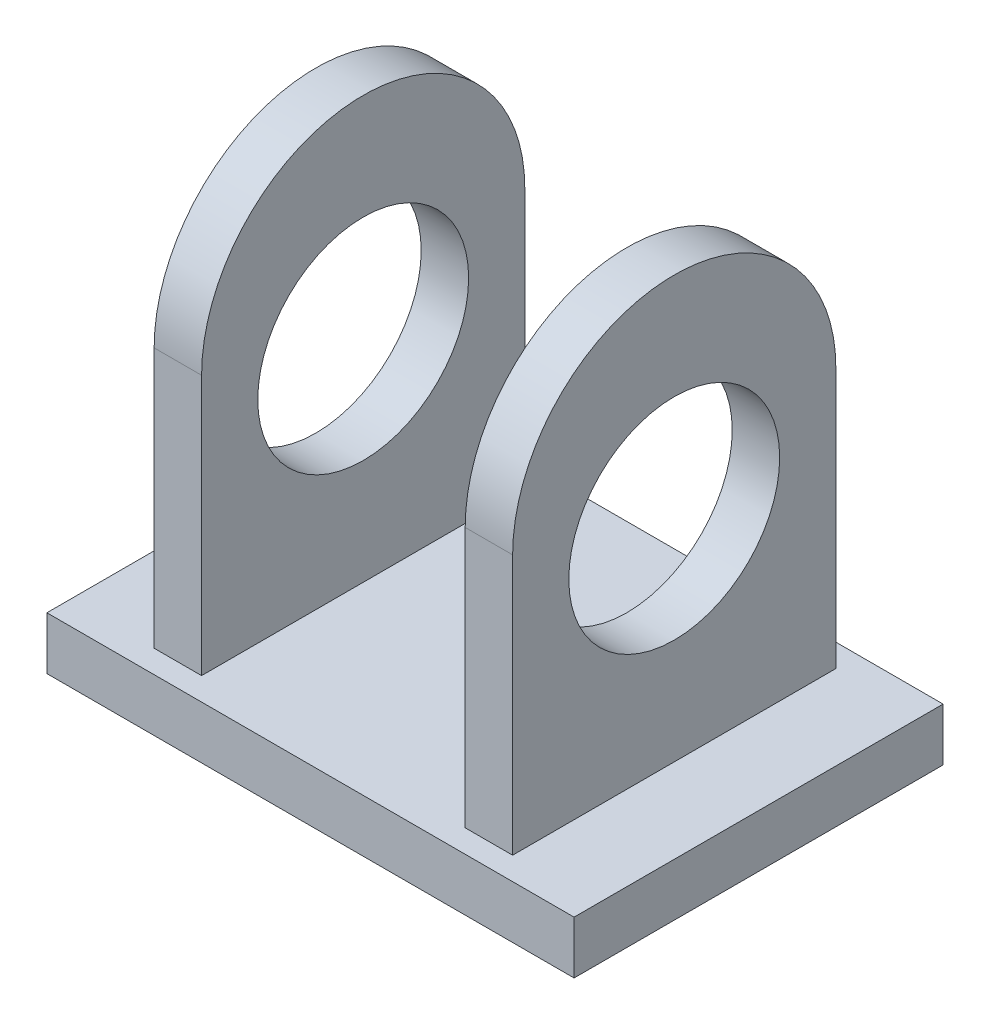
ISO-10303-21;
HEADER;
FILE_DESCRIPTION(('STEP AP214'),'2;1');
FILE_NAME('part.step','',(''),(''),'','','');
FILE_SCHEMA(('AUTOMOTIVE_DESIGN { 1 0 10303 214 1 1 1 1 }'));
ENDSEC;
DATA;
#1=APPLICATION_CONTEXT('core data for automotive mechanical design processes');
#2=APPLICATION_PROTOCOL_DEFINITION('international standard','automotive_design',2000,#1);
#3=PRODUCT_CONTEXT('',#1,'mechanical');
#4=PRODUCT('Part','Part','',(#3));
#5=PRODUCT_RELATED_PRODUCT_CATEGORY('part','',(#4));
#6=PRODUCT_DEFINITION_FORMATION('','',#4);
#7=PRODUCT_DEFINITION_CONTEXT('part definition',#1,'design');
#8=PRODUCT_DEFINITION('design','',#6,#7);
#9=PRODUCT_DEFINITION_SHAPE('','',#8);
#10=(LENGTH_UNIT() NAMED_UNIT(*) SI_UNIT(.MILLI.,.METRE.));
#11=(NAMED_UNIT(*) PLANE_ANGLE_UNIT() SI_UNIT($,.RADIAN.));
#12=(NAMED_UNIT(*) SI_UNIT($,.STERADIAN.) SOLID_ANGLE_UNIT());
#13=UNCERTAINTY_MEASURE_WITH_UNIT(LENGTH_MEASURE(1.E-05),#10,'distance_accuracy_value','');
#14=(GEOMETRIC_REPRESENTATION_CONTEXT(3) GLOBAL_UNCERTAINTY_ASSIGNED_CONTEXT((#13)) GLOBAL_UNIT_ASSIGNED_CONTEXT((#10,
#11,#12)) REPRESENTATION_CONTEXT('',''));
#15=CARTESIAN_POINT('',(0.,0.,0.));
#16=DIRECTION('',(0.,0.,1.));
#17=DIRECTION('',(1.,0.,0.));
#18=AXIS2_PLACEMENT_3D('',#15,#16,#17);
#19=CARTESIAN_POINT('',(17.,34.6714011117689,0.));
#20=DIRECTION('',(1.,0.,0.));
#21=DIRECTION('',(0.,0.,-1.));
#22=AXIS2_PLACEMENT_3D('',#19,#20,#21);
#23=CYLINDRICAL_SURFACE('',#22,15.3285988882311);
#24=CARTESIAN_POINT('',(-12.5,34.6714011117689,0.));
#25=DIRECTION('',(-1.,0.,0.));
#26=DIRECTION('',(0.,0.,1.));
#27=AXIS2_PLACEMENT_3D('',#24,#25,#26);
#28=CIRCLE('',#27,15.3285988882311);
#29=CARTESIAN_POINT('',(-12.5,34.6714011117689,-15.3285988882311));
#30=VERTEX_POINT('',#29);
#31=CARTESIAN_POINT('',(-12.5,34.6714011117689,15.3285988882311));
#32=VERTEX_POINT('',#31);
#33=EDGE_CURVE('E269',#30,#32,#28,.F.);
#34=ORIENTED_EDGE('',*,*,#33,.F.);
#35=DIRECTION('',(1.,0.,0.));
#36=VECTOR('',#35,1.);
#37=CARTESIAN_POINT('',(-17.,34.6714011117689,-15.3285988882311));
#38=LINE('',#37,#36);
#39=CARTESIAN_POINT('',(-17.,34.6714011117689,-15.3285988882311));
#40=VERTEX_POINT('',#39);
#41=EDGE_CURVE('E250',#40,#30,#38,.T.);
#42=ORIENTED_EDGE('',*,*,#41,.F.);
#43=CARTESIAN_POINT('',(-17.,34.6714011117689,0.));
#44=DIRECTION('',(1.,0.,0.));
#45=DIRECTION('',(0.,0.,-1.));
#46=AXIS2_PLACEMENT_3D('',#43,#44,#45);
#47=CIRCLE('',#46,15.3285988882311);
#48=CARTESIAN_POINT('',(-17.,34.6714011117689,15.3285988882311));
#49=VERTEX_POINT('',#48);
#50=EDGE_CURVE('E54',#49,#40,#47,.F.);
#51=ORIENTED_EDGE('',*,*,#50,.F.);
#52=DIRECTION('',(1.,0.,0.));
#53=VECTOR('',#52,1.);
#54=CARTESIAN_POINT('',(-17.,34.6714011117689,15.3285988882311));
#55=LINE('',#54,#53);
#56=EDGE_CURVE('E244',#32,#49,#55,.F.);
#57=ORIENTED_EDGE('',*,*,#56,.F.);
#58=EDGE_LOOP('',(#34,#42,#51,#57));
#59=FACE_BOUND('',#58,.T.);
#60=ADVANCED_FACE('F43',(#59),#23,.T.);
#61=CARTESIAN_POINT('',(-17.,50.,-15.3285988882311));
#62=DIRECTION('',(0.,0.,1.));
#63=DIRECTION('',(1.,0.,0.));
#64=AXIS2_PLACEMENT_3D('',#61,#62,#63);
#65=PLANE('',#64);
#66=ORIENTED_EDGE('',*,*,#41,.T.);
#67=DIRECTION('',(0.,-1.,0.));
#68=VECTOR('',#67,1.);
#69=CARTESIAN_POINT('',(-12.5,50.,-15.3285988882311));
#70=LINE('',#69,#68);
#71=CARTESIAN_POINT('',(-12.5,10.,-15.3285988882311));
#72=VERTEX_POINT('',#71);
#73=EDGE_CURVE('E274',#30,#72,#70,.T.);
#74=ORIENTED_EDGE('',*,*,#73,.T.);
#75=DIRECTION('',(-1.,0.,0.));
#76=VECTOR('',#75,1.);
#77=CARTESIAN_POINT('',(-17.,10.,-15.3285988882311));
#78=LINE('',#77,#76);
#79=CARTESIAN_POINT('',(-17.,10.,-15.3285988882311));
#80=VERTEX_POINT('',#79);
#81=EDGE_CURVE('E273',#72,#80,#78,.T.);
#82=ORIENTED_EDGE('',*,*,#81,.T.);
#83=DIRECTION('',(0.,-1.,0.));
#84=VECTOR('',#83,1.);
#85=CARTESIAN_POINT('',(-17.,50.,-15.3285988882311));
#86=LINE('',#85,#84);
#87=EDGE_CURVE('E182',#40,#80,#86,.T.);
#88=ORIENTED_EDGE('',*,*,#87,.F.);
#89=EDGE_LOOP('',(#66,#74,#82,#88));
#90=FACE_BOUND('',#89,.T.);
#91=ADVANCED_FACE('F272',(#90),#65,.F.);
#92=CARTESIAN_POINT('',(-17.,50.,15.3285988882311));
#93=DIRECTION('',(0.,0.,-1.));
#94=DIRECTION('',(-1.,0.,0.));
#95=AXIS2_PLACEMENT_3D('',#92,#93,#94);
#96=PLANE('',#95);
#97=DIRECTION('',(1.,0.,0.));
#98=VECTOR('',#97,1.);
#99=CARTESIAN_POINT('',(-17.,10.,15.3285988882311));
#100=LINE('',#99,#98);
#101=CARTESIAN_POINT('',(-17.,10.,15.3285988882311));
#102=VERTEX_POINT('',#101);
#103=CARTESIAN_POINT('',(-12.5,10.,15.3285988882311));
#104=VERTEX_POINT('',#103);
#105=EDGE_CURVE('E164',#102,#104,#100,.T.);
#106=ORIENTED_EDGE('',*,*,#105,.T.);
#107=DIRECTION('',(0.,1.,0.));
#108=VECTOR('',#107,1.);
#109=CARTESIAN_POINT('',(-12.5,50.,15.3285988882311));
#110=LINE('',#109,#108);
#111=EDGE_CURVE('E11',#104,#32,#110,.T.);
#112=ORIENTED_EDGE('',*,*,#111,.T.);
#113=ORIENTED_EDGE('',*,*,#56,.T.);
#114=DIRECTION('',(0.,-1.,0.));
#115=VECTOR('',#114,1.);
#116=CARTESIAN_POINT('',(-17.,50.,15.3285988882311));
#117=LINE('',#116,#115);
#118=EDGE_CURVE('E179',#49,#102,#117,.T.);
#119=ORIENTED_EDGE('',*,*,#118,.T.);
#120=EDGE_LOOP('',(#106,#112,#113,#119));
#121=FACE_BOUND('',#120,.T.);
#122=ADVANCED_FACE('F354',(#121),#96,.F.);
#123=CARTESIAN_POINT('',(12.5,34.6714011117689,0.));
#124=DIRECTION('',(1.,0.,0.));
#125=DIRECTION('',(0.,0.,-1.));
#126=AXIS2_PLACEMENT_3D('',#123,#124,#125);
#127=CIRCLE('',#126,15.3285988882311);
#128=CARTESIAN_POINT('',(12.5,34.6714011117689,15.3285988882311));
#129=VERTEX_POINT('',#128);
#130=CARTESIAN_POINT('',(12.5,34.6714011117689,-15.3285988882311));
#131=VERTEX_POINT('',#130);
#132=EDGE_CURVE('E285',#129,#131,#127,.F.);
#133=ORIENTED_EDGE('',*,*,#132,.F.);
#134=CARTESIAN_POINT('',(17.,34.6714011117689,15.3285988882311));
#135=VERTEX_POINT('',#134);
#136=EDGE_CURVE('E155',#135,#129,#55,.F.);
#137=ORIENTED_EDGE('',*,*,#136,.F.);
#138=CARTESIAN_POINT('',(17.,34.6714011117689,0.));
#139=DIRECTION('',(-1.,0.,0.));
#140=DIRECTION('',(0.,0.,1.));
#141=AXIS2_PLACEMENT_3D('',#138,#139,#140);
#142=CIRCLE('',#141,15.3285988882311);
#143=CARTESIAN_POINT('',(17.,34.6714011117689,-15.3285988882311));
#144=VERTEX_POINT('',#143);
#145=EDGE_CURVE('E254',#144,#135,#142,.F.);
#146=ORIENTED_EDGE('',*,*,#145,.F.);
#147=EDGE_CURVE('E69',#131,#144,#38,.T.);
#148=ORIENTED_EDGE('',*,*,#147,.F.);
#149=EDGE_LOOP('',(#133,#137,#146,#148));
#150=FACE_BOUND('',#149,.T.);
#151=ADVANCED_FACE('F46',(#150),#23,.T.);
#152=CARTESIAN_POINT('',(0.,10.,0.));
#153=DIRECTION('',(0.,-1.,0.));
#154=DIRECTION('',(0.,0.,-1.));
#155=AXIS2_PLACEMENT_3D('',#152,#153,#154);
#156=PLANE('',#155);
#157=DIRECTION('',(-1.,0.,0.));
#158=VECTOR('',#157,1.);
#159=CARTESIAN_POINT('',(-25.,10.,-17.5));
#160=LINE('',#159,#158);
#161=CARTESIAN_POINT('',(25.,10.,-17.5));
#162=VERTEX_POINT('',#161);
#163=CARTESIAN_POINT('',(-25.,10.,-17.5));
#164=VERTEX_POINT('',#163);
#165=EDGE_CURVE('E194',#162,#164,#160,.T.);
#166=ORIENTED_EDGE('',*,*,#165,.T.);
#167=DIRECTION('',(0.,0.,1.));
#168=VECTOR('',#167,1.);
#169=CARTESIAN_POINT('',(-25.,10.,17.5));
#170=LINE('',#169,#168);
#171=CARTESIAN_POINT('',(-25.,10.,17.5));
#172=VERTEX_POINT('',#171);
#173=EDGE_CURVE('E198',#164,#172,#170,.T.);
#174=ORIENTED_EDGE('',*,*,#173,.T.);
#175=DIRECTION('',(1.,0.,0.));
#176=VECTOR('',#175,1.);
#177=CARTESIAN_POINT('',(-25.,10.,17.5));
#178=LINE('',#177,#176);
#179=CARTESIAN_POINT('',(25.,10.,17.5));
#180=VERTEX_POINT('',#179);
#181=EDGE_CURVE('E201',#172,#180,#178,.T.);
#182=ORIENTED_EDGE('',*,*,#181,.T.);
#183=DIRECTION('',(0.,0.,-1.));
#184=VECTOR('',#183,1.);
#185=CARTESIAN_POINT('',(25.,10.,17.5));
#186=LINE('',#185,#184);
#187=EDGE_CURVE('E190',#180,#162,#186,.T.);
#188=ORIENTED_EDGE('',*,*,#187,.T.);
#189=EDGE_LOOP('',(#166,#174,#182,#188));
#190=FACE_BOUND('',#189,.T.);
#191=DIRECTION('',(0.,0.,1.));
#192=VECTOR('',#191,1.);
#193=CARTESIAN_POINT('',(12.5,10.,-17.5));
#194=LINE('',#193,#192);
#195=CARTESIAN_POINT('',(12.5,10.,-15.3285988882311));
#196=VERTEX_POINT('',#195);
#197=CARTESIAN_POINT('',(12.5,10.,15.3285988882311));
#198=VERTEX_POINT('',#197);
#199=EDGE_CURVE('E136',#196,#198,#194,.T.);
#200=ORIENTED_EDGE('',*,*,#199,.F.);
#201=CARTESIAN_POINT('',(17.,10.,-15.3285988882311));
#202=VERTEX_POINT('',#201);
#203=EDGE_CURVE('E173',#202,#196,#78,.T.);
#204=ORIENTED_EDGE('',*,*,#203,.F.);
#205=DIRECTION('',(0.,0.,-1.));
#206=VECTOR('',#205,1.);
#207=CARTESIAN_POINT('',(17.,10.,15.3285988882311));
#208=LINE('',#207,#206);
#209=CARTESIAN_POINT('',(17.,10.,15.3285988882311));
#210=VERTEX_POINT('',#209);
#211=EDGE_CURVE('E162',#210,#202,#208,.T.);
#212=ORIENTED_EDGE('',*,*,#211,.F.);
#213=EDGE_CURVE('E152',#198,#210,#100,.T.);
#214=ORIENTED_EDGE('',*,*,#213,.F.);
#215=EDGE_LOOP('',(#200,#204,#212,#214));
#216=FACE_BOUND('',#215,.T.);
#217=ORIENTED_EDGE('',*,*,#81,.F.);
#218=DIRECTION('',(0.,0.,1.));
#219=VECTOR('',#218,1.);
#220=CARTESIAN_POINT('',(-12.5,10.,-17.5));
#221=LINE('',#220,#219);
#222=EDGE_CURVE('E61',#72,#104,#221,.T.);
#223=ORIENTED_EDGE('',*,*,#222,.T.);
#224=ORIENTED_EDGE('',*,*,#105,.F.);
#225=DIRECTION('',(0.,0.,1.));
#226=VECTOR('',#225,1.);
#227=CARTESIAN_POINT('',(-17.,10.,15.3285988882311));
#228=LINE('',#227,#226);
#229=EDGE_CURVE('E165',#80,#102,#228,.T.);
#230=ORIENTED_EDGE('',*,*,#229,.F.);
#231=EDGE_LOOP('',(#217,#223,#224,#230));
#232=FACE_BOUND('',#231,.T.);
#233=ADVANCED_FACE('F160',(#190,#216,#232),#156,.F.);
#234=CARTESIAN_POINT('',(0.,0.,0.));
#235=DIRECTION('',(0.,1.,0.));
#236=DIRECTION('',(0.,0.,1.));
#237=AXIS2_PLACEMENT_3D('',#234,#235,#236);
#238=PLANE('',#237);
#239=CARTESIAN_POINT('',(0.,0.,0.));
#240=DIRECTION('',(0.,1.,0.));
#241=DIRECTION('',(0.,0.,1.));
#242=AXIS2_PLACEMENT_3D('',#239,#240,#241);
#243=CIRCLE('',#242,11.5);
#244=CARTESIAN_POINT('',(0.,0.,11.5));
#245=VERTEX_POINT('',#244);
#246=EDGE_CURVE('E239',#245,#245,#243,.T.);
#247=ORIENTED_EDGE('',*,*,#246,.F.);
#248=EDGE_LOOP('',(#247));
#249=FACE_BOUND('',#248,.T.);
#250=CARTESIAN_POINT('',(0.,0.,0.));
#251=DIRECTION('',(0.,1.,0.));
#252=DIRECTION('',(0.,0.,1.));
#253=AXIS2_PLACEMENT_3D('',#250,#251,#252);
#254=CIRCLE('',#253,10.5);
#255=CARTESIAN_POINT('',(0.,0.,10.5));
#256=VERTEX_POINT('',#255);
#257=EDGE_CURVE('E235',#256,#256,#254,.T.);
#258=ORIENTED_EDGE('',*,*,#257,.T.);
#259=EDGE_LOOP('',(#258));
#260=FACE_BOUND('',#259,.T.);
#261=ADVANCED_FACE('F376',(#249,#260),#238,.F.);
#262=CARTESIAN_POINT('',(0.,5.,0.));
#263=DIRECTION('',(0.,-1.,0.));
#264=DIRECTION('',(0.,0.,-1.));
#265=AXIS2_PLACEMENT_3D('',#262,#263,#264);
#266=CYLINDRICAL_SURFACE('',#265,11.5);
#267=CARTESIAN_POINT('',(0.,5.,0.));
#268=DIRECTION('',(0.,1.,0.));
#269=DIRECTION('',(0.,0.,1.));
#270=AXIS2_PLACEMENT_3D('',#267,#268,#269);
#271=CIRCLE('',#270,11.5);
#272=CARTESIAN_POINT('',(0.,5.,11.5));
#273=VERTEX_POINT('',#272);
#274=EDGE_CURVE('E240',#273,#273,#271,.T.);
#275=ORIENTED_EDGE('',*,*,#274,.F.);
#276=EDGE_LOOP('',(#275));
#277=FACE_BOUND('',#276,.T.);
#278=ORIENTED_EDGE('',*,*,#246,.T.);
#279=EDGE_LOOP('',(#278));
#280=FACE_BOUND('',#279,.T.);
#281=ADVANCED_FACE('F409',(#277,#280),#266,.T.);
#282=CARTESIAN_POINT('',(0.,5.,0.));
#283=DIRECTION('',(0.,-1.,0.));
#284=DIRECTION('',(0.,0.,-1.));
#285=AXIS2_PLACEMENT_3D('',#282,#283,#284);
#286=CYLINDRICAL_SURFACE('',#285,10.5);
#287=CARTESIAN_POINT('',(0.,5.,0.));
#288=DIRECTION('',(0.,1.,0.));
#289=DIRECTION('',(0.,0.,1.));
#290=AXIS2_PLACEMENT_3D('',#287,#288,#289);
#291=CIRCLE('',#290,10.5);
#292=CARTESIAN_POINT('',(0.,5.,10.5));
#293=VERTEX_POINT('',#292);
#294=EDGE_CURVE('E231',#293,#293,#291,.T.);
#295=ORIENTED_EDGE('',*,*,#294,.T.);
#296=EDGE_LOOP('',(#295));
#297=FACE_BOUND('',#296,.T.);
#298=ORIENTED_EDGE('',*,*,#257,.F.);
#299=EDGE_LOOP('',(#298));
#300=FACE_BOUND('',#299,.T.);
#301=ADVANCED_FACE('F406',(#297,#300),#286,.F.);
#302=CARTESIAN_POINT('',(0.,5.,0.));
#303=DIRECTION('',(0.,-1.,0.));
#304=DIRECTION('',(0.,0.,-1.));
#305=AXIS2_PLACEMENT_3D('',#302,#303,#304);
#306=PLANE('',#305);
#307=ORIENTED_EDGE('',*,*,#294,.F.);
#308=EDGE_LOOP('',(#307));
#309=FACE_BOUND('',#308,.T.);
#310=ADVANCED_FACE('F390',(#309),#306,.T.);
#311=CARTESIAN_POINT('',(25.,10.,17.5));
#312=DIRECTION('',(-1.,0.,0.));
#313=DIRECTION('',(0.,0.,1.));
#314=AXIS2_PLACEMENT_3D('',#311,#312,#313);
#315=PLANE('',#314);
#316=DIRECTION('',(0.,0.,-1.));
#317=VECTOR('',#316,1.);
#318=CARTESIAN_POINT('',(25.,5.,17.5));
#319=LINE('',#318,#317);
#320=CARTESIAN_POINT('',(25.,5.,17.5));
#321=VERTEX_POINT('',#320);
#322=CARTESIAN_POINT('',(25.,5.,-17.5));
#323=VERTEX_POINT('',#322);
#324=EDGE_CURVE('E189',#321,#323,#319,.T.);
#325=ORIENTED_EDGE('',*,*,#324,.T.);
#326=DIRECTION('',(0.,-1.,0.));
#327=VECTOR('',#326,1.);
#328=CARTESIAN_POINT('',(25.,10.,-17.5));
#329=LINE('',#328,#327);
#330=EDGE_CURVE('E227',#162,#323,#329,.T.);
#331=ORIENTED_EDGE('',*,*,#330,.F.);
#332=ORIENTED_EDGE('',*,*,#187,.F.);
#333=DIRECTION('',(0.,-1.,0.));
#334=VECTOR('',#333,1.);
#335=CARTESIAN_POINT('',(25.,10.,17.5));
#336=LINE('',#335,#334);
#337=EDGE_CURVE('E204',#180,#321,#336,.T.);
#338=ORIENTED_EDGE('',*,*,#337,.T.);
#339=EDGE_LOOP('',(#325,#331,#332,#338));
#340=FACE_BOUND('',#339,.T.);
#341=ADVANCED_FACE('F401',(#340),#315,.F.);
#342=CARTESIAN_POINT('',(-25.,10.,-17.5));
#343=DIRECTION('',(0.,0.,1.));
#344=DIRECTION('',(1.,0.,0.));
#345=AXIS2_PLACEMENT_3D('',#342,#343,#344);
#346=PLANE('',#345);
#347=DIRECTION('',(-1.,0.,0.));
#348=VECTOR('',#347,1.);
#349=CARTESIAN_POINT('',(-25.,5.,-17.5));
#350=LINE('',#349,#348);
#351=CARTESIAN_POINT('',(-25.,5.,-17.5));
#352=VERTEX_POINT('',#351);
#353=EDGE_CURVE('E208',#323,#352,#350,.T.);
#354=ORIENTED_EDGE('',*,*,#353,.T.);
#355=DIRECTION('',(0.,-1.,0.));
#356=VECTOR('',#355,1.);
#357=CARTESIAN_POINT('',(-25.,10.,-17.5));
#358=LINE('',#357,#356);
#359=EDGE_CURVE('E223',#164,#352,#358,.T.);
#360=ORIENTED_EDGE('',*,*,#359,.F.);
#361=ORIENTED_EDGE('',*,*,#165,.F.);
#362=ORIENTED_EDGE('',*,*,#330,.T.);
#363=EDGE_LOOP('',(#354,#360,#361,#362));
#364=FACE_BOUND('',#363,.T.);
#365=ADVANCED_FACE('F397',(#364),#346,.F.);
#366=CARTESIAN_POINT('',(-25.,10.,17.5));
#367=DIRECTION('',(1.,0.,0.));
#368=DIRECTION('',(0.,0.,-1.));
#369=AXIS2_PLACEMENT_3D('',#366,#367,#368);
#370=PLANE('',#369);
#371=DIRECTION('',(0.,0.,1.));
#372=VECTOR('',#371,1.);
#373=CARTESIAN_POINT('',(-25.,5.,17.5));
#374=LINE('',#373,#372);
#375=CARTESIAN_POINT('',(-25.,5.,17.5));
#376=VERTEX_POINT('',#375);
#377=EDGE_CURVE('E211',#352,#376,#374,.T.);
#378=ORIENTED_EDGE('',*,*,#377,.T.);
#379=DIRECTION('',(0.,-1.,0.));
#380=VECTOR('',#379,1.);
#381=CARTESIAN_POINT('',(-25.,10.,17.5));
#382=LINE('',#381,#380);
#383=EDGE_CURVE('E219',#172,#376,#382,.T.);
#384=ORIENTED_EDGE('',*,*,#383,.F.);
#385=ORIENTED_EDGE('',*,*,#173,.F.);
#386=ORIENTED_EDGE('',*,*,#359,.T.);
#387=EDGE_LOOP('',(#378,#384,#385,#386));
#388=FACE_BOUND('',#387,.T.);
#389=ADVANCED_FACE('F393',(#388),#370,.F.);
#390=CARTESIAN_POINT('',(-25.,10.,17.5));
#391=DIRECTION('',(0.,0.,-1.));
#392=DIRECTION('',(-1.,0.,0.));
#393=AXIS2_PLACEMENT_3D('',#390,#391,#392);
#394=PLANE('',#393);
#395=DIRECTION('',(1.,0.,0.));
#396=VECTOR('',#395,1.);
#397=CARTESIAN_POINT('',(-25.,5.,17.5));
#398=LINE('',#397,#396);
#399=EDGE_CURVE('E195',#376,#321,#398,.T.);
#400=ORIENTED_EDGE('',*,*,#399,.T.);
#401=ORIENTED_EDGE('',*,*,#337,.F.);
#402=ORIENTED_EDGE('',*,*,#181,.F.);
#403=ORIENTED_EDGE('',*,*,#383,.T.);
#404=EDGE_LOOP('',(#400,#401,#402,#403));
#405=FACE_BOUND('',#404,.T.);
#406=ADVANCED_FACE('F388',(#405),#394,.F.);
#407=ORIENTED_EDGE('',*,*,#274,.T.);
#408=EDGE_LOOP('',(#407));
#409=FACE_BOUND('',#408,.T.);
#410=ORIENTED_EDGE('',*,*,#324,.F.);
#411=ORIENTED_EDGE('',*,*,#399,.F.);
#412=ORIENTED_EDGE('',*,*,#377,.F.);
#413=ORIENTED_EDGE('',*,*,#353,.F.);
#414=EDGE_LOOP('',(#410,#411,#412,#413));
#415=FACE_BOUND('',#414,.T.);
#416=ADVANCED_FACE('F322',(#409,#415),#306,.T.);
#417=CARTESIAN_POINT('',(17.,50.,15.3285988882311));
#418=DIRECTION('',(-1.,0.,0.));
#419=DIRECTION('',(0.,0.,1.));
#420=AXIS2_PLACEMENT_3D('',#417,#418,#419);
#421=PLANE('',#420);
#422=CARTESIAN_POINT('',(17.,30.,0.));
#423=DIRECTION('',(-1.,0.,0.));
#424=DIRECTION('',(0.,0.,1.));
#425=AXIS2_PLACEMENT_3D('',#422,#423,#424);
#426=CIRCLE('',#425,10.);
#427=CARTESIAN_POINT('',(17.,30.,10.));
#428=VERTEX_POINT('',#427);
#429=EDGE_CURVE('E157',#428,#428,#426,.T.);
#430=ORIENTED_EDGE('',*,*,#429,.T.);
#431=EDGE_LOOP('',(#430));
#432=FACE_BOUND('',#431,.T.);
#433=DIRECTION('',(0.,-1.,0.));
#434=VECTOR('',#433,1.);
#435=CARTESIAN_POINT('',(17.,50.,-15.3285988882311));
#436=LINE('',#435,#434);
#437=EDGE_CURVE('E186',#144,#202,#436,.T.);
#438=ORIENTED_EDGE('',*,*,#437,.F.);
#439=ORIENTED_EDGE('',*,*,#145,.T.);
#440=DIRECTION('',(0.,-1.,0.));
#441=VECTOR('',#440,1.);
#442=CARTESIAN_POINT('',(17.,50.,15.3285988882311));
#443=LINE('',#442,#441);
#444=EDGE_CURVE('E171',#135,#210,#443,.T.);
#445=ORIENTED_EDGE('',*,*,#444,.T.);
#446=ORIENTED_EDGE('',*,*,#211,.T.);
#447=EDGE_LOOP('',(#438,#439,#445,#446));
#448=FACE_BOUND('',#447,.T.);
#449=ADVANCED_FACE('F318',(#432,#448),#421,.F.);
#450=ORIENTED_EDGE('',*,*,#203,.T.);
#451=DIRECTION('',(0.,1.,0.));
#452=VECTOR('',#451,1.);
#453=CARTESIAN_POINT('',(12.5,50.,-15.3285988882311));
#454=LINE('',#453,#452);
#455=EDGE_CURVE('E141',#196,#131,#454,.T.);
#456=ORIENTED_EDGE('',*,*,#455,.T.);
#457=ORIENTED_EDGE('',*,*,#147,.T.);
#458=ORIENTED_EDGE('',*,*,#437,.T.);
#459=EDGE_LOOP('',(#450,#456,#457,#458));
#460=FACE_BOUND('',#459,.T.);
#461=ADVANCED_FACE('F321',(#460),#65,.F.);
#462=CARTESIAN_POINT('',(-17.,50.,15.3285988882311));
#463=DIRECTION('',(1.,0.,0.));
#464=DIRECTION('',(0.,0.,-1.));
#465=AXIS2_PLACEMENT_3D('',#462,#463,#464);
#466=PLANE('',#465);
#467=CARTESIAN_POINT('',(-17.,30.,0.));
#468=DIRECTION('',(1.,0.,0.));
#469=DIRECTION('',(0.,0.,-1.));
#470=AXIS2_PLACEMENT_3D('',#467,#468,#469);
#471=CIRCLE('',#470,10.);
#472=CARTESIAN_POINT('',(-17.,30.,-10.));
#473=VERTEX_POINT('',#472);
#474=EDGE_CURVE('E295',#473,#473,#471,.T.);
#475=ORIENTED_EDGE('',*,*,#474,.T.);
#476=EDGE_LOOP('',(#475));
#477=FACE_BOUND('',#476,.T.);
#478=ORIENTED_EDGE('',*,*,#118,.F.);
#479=ORIENTED_EDGE('',*,*,#50,.T.);
#480=ORIENTED_EDGE('',*,*,#87,.T.);
#481=ORIENTED_EDGE('',*,*,#229,.T.);
#482=EDGE_LOOP('',(#478,#479,#480,#481));
#483=FACE_BOUND('',#482,.T.);
#484=ADVANCED_FACE('F263',(#477,#483),#466,.F.);
#485=ORIENTED_EDGE('',*,*,#136,.T.);
#486=DIRECTION('',(0.,1.,0.));
#487=VECTOR('',#486,1.);
#488=CARTESIAN_POINT('',(12.5,10.,15.3285988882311));
#489=LINE('',#488,#487);
#490=EDGE_CURVE('E139',#198,#129,#489,.T.);
#491=ORIENTED_EDGE('',*,*,#490,.F.);
#492=ORIENTED_EDGE('',*,*,#213,.T.);
#493=ORIENTED_EDGE('',*,*,#444,.F.);
#494=EDGE_LOOP('',(#485,#491,#492,#493));
#495=FACE_BOUND('',#494,.T.);
#496=ADVANCED_FACE('F150',(#495),#96,.F.);
#497=CARTESIAN_POINT('',(-12.5,10.,-17.5));
#498=DIRECTION('',(-1.,0.,0.));
#499=DIRECTION('',(0.,0.,1.));
#500=AXIS2_PLACEMENT_3D('',#497,#498,#499);
#501=PLANE('',#500);
#502=CARTESIAN_POINT('',(-12.5,30.,0.));
#503=DIRECTION('',(-1.,0.,0.));
#504=DIRECTION('',(0.,0.,1.));
#505=AXIS2_PLACEMENT_3D('',#502,#503,#504);
#506=CIRCLE('',#505,10.);
#507=CARTESIAN_POINT('',(-12.5,30.,10.));
#508=VERTEX_POINT('',#507);
#509=EDGE_CURVE('E299',#508,#508,#506,.T.);
#510=ORIENTED_EDGE('',*,*,#509,.T.);
#511=EDGE_LOOP('',(#510));
#512=FACE_BOUND('',#511,.T.);
#513=ORIENTED_EDGE('',*,*,#33,.T.);
#514=ORIENTED_EDGE('',*,*,#111,.F.);
#515=ORIENTED_EDGE('',*,*,#222,.F.);
#516=ORIENTED_EDGE('',*,*,#73,.F.);
#517=EDGE_LOOP('',(#513,#514,#515,#516));
#518=FACE_BOUND('',#517,.T.);
#519=ADVANCED_FACE('F356',(#512,#518),#501,.F.);
#520=CARTESIAN_POINT('',(12.5,10.,-17.5));
#521=DIRECTION('',(1.,0.,0.));
#522=DIRECTION('',(0.,0.,-1.));
#523=AXIS2_PLACEMENT_3D('',#520,#521,#522);
#524=PLANE('',#523);
#525=CARTESIAN_POINT('',(12.5,30.,0.));
#526=DIRECTION('',(1.,0.,0.));
#527=DIRECTION('',(0.,0.,-1.));
#528=AXIS2_PLACEMENT_3D('',#525,#526,#527);
#529=CIRCLE('',#528,10.);
#530=CARTESIAN_POINT('',(12.5,30.,-10.));
#531=VERTEX_POINT('',#530);
#532=EDGE_CURVE('E48',#531,#531,#529,.T.);
#533=ORIENTED_EDGE('',*,*,#532,.T.);
#534=EDGE_LOOP('',(#533));
#535=FACE_BOUND('',#534,.T.);
#536=ORIENTED_EDGE('',*,*,#132,.T.);
#537=ORIENTED_EDGE('',*,*,#455,.F.);
#538=ORIENTED_EDGE('',*,*,#199,.T.);
#539=ORIENTED_EDGE('',*,*,#490,.T.);
#540=EDGE_LOOP('',(#536,#537,#538,#539));
#541=FACE_BOUND('',#540,.T.);
#542=ADVANCED_FACE('F138',(#535,#541),#524,.F.);
#543=CARTESIAN_POINT('',(34.,30.,0.));
#544=DIRECTION('',(-1.,0.,0.));
#545=DIRECTION('',(0.,0.,1.));
#546=AXIS2_PLACEMENT_3D('',#543,#544,#545);
#547=CYLINDRICAL_SURFACE('',#546,10.);
#548=ORIENTED_EDGE('',*,*,#532,.F.);
#549=EDGE_LOOP('',(#548));
#550=FACE_BOUND('',#549,.T.);
#551=ORIENTED_EDGE('',*,*,#429,.F.);
#552=EDGE_LOOP('',(#551));
#553=FACE_BOUND('',#552,.T.);
#554=ADVANCED_FACE('F311',(#550,#553),#547,.F.);
#555=ORIENTED_EDGE('',*,*,#509,.F.);
#556=EDGE_LOOP('',(#555));
#557=FACE_BOUND('',#556,.T.);
#558=ORIENTED_EDGE('',*,*,#474,.F.);
#559=EDGE_LOOP('',(#558));
#560=FACE_BOUND('',#559,.T.);
#561=ADVANCED_FACE('F314',(#557,#560),#547,.F.);
#562=CLOSED_SHELL('',(#60,#91,#122,#151,#233,#261,#281,#301,#310,#341,#365,#389,#406,#416,#449,
#461,#484,#496,#519,#542,#554,#561));
#563=MANIFOLD_SOLID_BREP('B2',#562);
#564=ADVANCED_BREP_SHAPE_REPRESENTATION('',(#18,#563),#14);
#565=SHAPE_DEFINITION_REPRESENTATION(#9,#564);
ENDSEC;
END-ISO-10303-21;
